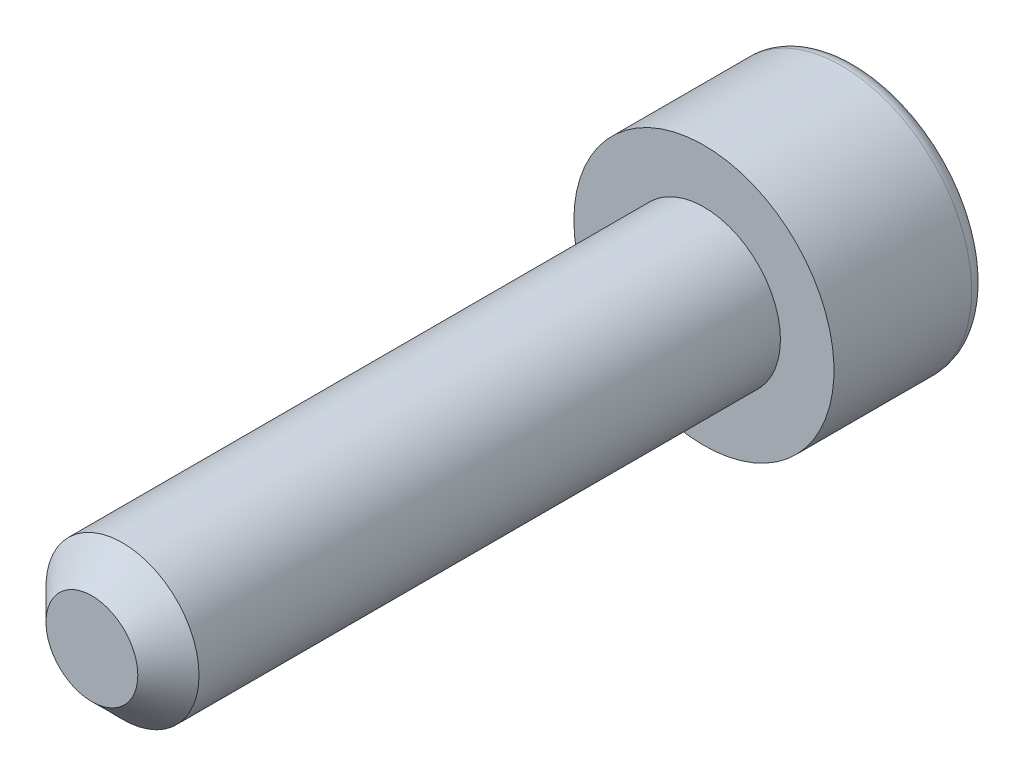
ISO-10303-21;
HEADER;
FILE_DESCRIPTION(('STEP AP214'),'2;1');
FILE_NAME('part.step','',(''),(''),'','','');
FILE_SCHEMA(('AUTOMOTIVE_DESIGN { 1 0 10303 214 1 1 1 1 }'));
ENDSEC;
DATA;
#1=APPLICATION_CONTEXT('core data for automotive mechanical design processes');
#2=APPLICATION_PROTOCOL_DEFINITION('international standard','automotive_design',2000,#1);
#3=PRODUCT_CONTEXT('',#1,'mechanical');
#4=PRODUCT('Part','Part','',(#3));
#5=PRODUCT_RELATED_PRODUCT_CATEGORY('part','',(#4));
#6=PRODUCT_DEFINITION_FORMATION('','',#4);
#7=PRODUCT_DEFINITION_CONTEXT('part definition',#1,'design');
#8=PRODUCT_DEFINITION('design','',#6,#7);
#9=PRODUCT_DEFINITION_SHAPE('','',#8);
#10=(LENGTH_UNIT() NAMED_UNIT(*) SI_UNIT(.MILLI.,.METRE.));
#11=(NAMED_UNIT(*) PLANE_ANGLE_UNIT() SI_UNIT($,.RADIAN.));
#12=(NAMED_UNIT(*) SI_UNIT($,.STERADIAN.) SOLID_ANGLE_UNIT());
#13=UNCERTAINTY_MEASURE_WITH_UNIT(LENGTH_MEASURE(1.E-05),#10,'distance_accuracy_value','');
#14=(GEOMETRIC_REPRESENTATION_CONTEXT(3) GLOBAL_UNCERTAINTY_ASSIGNED_CONTEXT((#13)) GLOBAL_UNIT_ASSIGNED_CONTEXT((#10,
#11,#12)) REPRESENTATION_CONTEXT('',''));
#15=CARTESIAN_POINT('',(0.,0.,0.));
#16=DIRECTION('',(0.,0.,1.));
#17=DIRECTION('',(1.,0.,0.));
#18=AXIS2_PLACEMENT_3D('',#15,#16,#17);
#19=CARTESIAN_POINT('',(0.,0.,-5.));
#20=DIRECTION('',(0.,0.,1.));
#21=DIRECTION('',(1.,0.,0.));
#22=AXIS2_PLACEMENT_3D('',#19,#20,#21);
#23=PLANE('',#22);
#24=CARTESIAN_POINT('',(0.,0.,-5.));
#25=DIRECTION('',(0.,0.,-1.));
#26=DIRECTION('',(-1.,0.,0.));
#27=AXIS2_PLACEMENT_3D('',#24,#25,#26);
#28=CIRCLE('',#27,3.75);
#29=CARTESIAN_POINT('',(-3.75,0.,-5.));
#30=VERTEX_POINT('',#29);
#31=EDGE_CURVE('E460',#30,#30,#28,.T.);
#32=ORIENTED_EDGE('',*,*,#31,.T.);
#33=EDGE_LOOP('',(#32));
#34=FACE_BOUND('',#33,.T.);
#35=DIRECTION('',(-0.86602540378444,0.499999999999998,0.));
#36=VECTOR('',#35,1.);
#37=CARTESIAN_POINT('',(0.,2.3094010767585,-5.));
#38=LINE('',#37,#36);
#39=CARTESIAN_POINT('',(2.,1.15470053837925,-5.));
#40=VERTEX_POINT('',#39);
#41=CARTESIAN_POINT('',(0.,2.3094010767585,-5.));
#42=VERTEX_POINT('',#41);
#43=EDGE_CURVE('E364',#40,#42,#38,.T.);
#44=ORIENTED_EDGE('',*,*,#43,.T.);
#45=DIRECTION('',(-0.866025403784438,-0.500000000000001,0.));
#46=VECTOR('',#45,1.);
#47=CARTESIAN_POINT('',(0.,2.3094010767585,-5.));
#48=LINE('',#47,#46);
#49=CARTESIAN_POINT('',(-2.,1.15470053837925,-5.));
#50=VERTEX_POINT('',#49);
#51=EDGE_CURVE('E404',#42,#50,#48,.T.);
#52=ORIENTED_EDGE('',*,*,#51,.T.);
#53=DIRECTION('',(0.,-1.,0.));
#54=VECTOR('',#53,1.);
#55=CARTESIAN_POINT('',(-2.,-1.15470053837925,-5.));
#56=LINE('',#55,#54);
#57=CARTESIAN_POINT('',(-2.,-1.15470053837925,-5.));
#58=VERTEX_POINT('',#57);
#59=EDGE_CURVE('E412',#50,#58,#56,.T.);
#60=ORIENTED_EDGE('',*,*,#59,.T.);
#61=DIRECTION('',(0.866025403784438,-0.500000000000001,0.));
#62=VECTOR('',#61,1.);
#63=CARTESIAN_POINT('',(0.,-2.3094010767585,-5.));
#64=LINE('',#63,#62);
#65=CARTESIAN_POINT('',(0.,-2.3094010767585,-5.));
#66=VERTEX_POINT('',#65);
#67=EDGE_CURVE('E430',#58,#66,#64,.T.);
#68=ORIENTED_EDGE('',*,*,#67,.T.);
#69=DIRECTION('',(0.86602540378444,0.499999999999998,0.));
#70=VECTOR('',#69,1.);
#71=CARTESIAN_POINT('',(0.,-2.3094010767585,-5.));
#72=LINE('',#71,#70);
#73=CARTESIAN_POINT('',(2.,-1.15470053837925,-5.));
#74=VERTEX_POINT('',#73);
#75=EDGE_CURVE('E433',#66,#74,#72,.T.);
#76=ORIENTED_EDGE('',*,*,#75,.T.);
#77=DIRECTION('',(0.,1.,0.));
#78=VECTOR('',#77,1.);
#79=CARTESIAN_POINT('',(2.,-1.15470053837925,-5.));
#80=LINE('',#79,#78);
#81=EDGE_CURVE('E423',#74,#40,#80,.T.);
#82=ORIENTED_EDGE('',*,*,#81,.T.);
#83=EDGE_LOOP('',(#44,#52,#60,#68,#76,#82));
#84=FACE_BOUND('',#83,.T.);
#85=ADVANCED_FACE('F350',(#34,#84),#23,.F.);
#86=CARTESIAN_POINT('',(0.,0.,-4.5));
#87=DIRECTION('',(0.,0.,-1.));
#88=DIRECTION('',(-1.,0.,0.));
#89=AXIS2_PLACEMENT_3D('',#86,#87,#88);
#90=TOROIDAL_SURFACE('',#89,3.75,0.5);
#91=ORIENTED_EDGE('',*,*,#31,.F.);
#92=EDGE_LOOP('',(#91));
#93=FACE_BOUND('',#92,.T.);
#94=CARTESIAN_POINT('',(0.,0.,-4.5));
#95=DIRECTION('',(0.,0.,-1.));
#96=DIRECTION('',(-1.,0.,0.));
#97=AXIS2_PLACEMENT_3D('',#94,#95,#96);
#98=CIRCLE('',#97,4.25);
#99=CARTESIAN_POINT('',(-4.25,0.,-4.5));
#100=VERTEX_POINT('',#99);
#101=EDGE_CURVE('E457',#100,#100,#98,.T.);
#102=ORIENTED_EDGE('',*,*,#101,.T.);
#103=EDGE_LOOP('',(#102));
#104=FACE_BOUND('',#103,.T.);
#105=ADVANCED_FACE('F479',(#93,#104),#90,.T.);
#106=CARTESIAN_POINT('',(0.,0.,0.));
#107=DIRECTION('',(0.,0.,-1.));
#108=DIRECTION('',(-1.,0.,0.));
#109=AXIS2_PLACEMENT_3D('',#106,#107,#108);
#110=CYLINDRICAL_SURFACE('',#109,4.25);
#111=ORIENTED_EDGE('',*,*,#101,.F.);
#112=EDGE_LOOP('',(#111));
#113=FACE_BOUND('',#112,.T.);
#114=CARTESIAN_POINT('',(0.,0.,0.));
#115=DIRECTION('',(0.,0.,-1.));
#116=DIRECTION('',(-1.,0.,0.));
#117=AXIS2_PLACEMENT_3D('',#114,#115,#116);
#118=CIRCLE('',#117,4.25);
#119=CARTESIAN_POINT('',(-4.25,0.,0.));
#120=VERTEX_POINT('',#119);
#121=EDGE_CURVE('E418',#120,#120,#118,.T.);
#122=ORIENTED_EDGE('',*,*,#121,.T.);
#123=EDGE_LOOP('',(#122));
#124=FACE_BOUND('',#123,.T.);
#125=ADVANCED_FACE('F484',(#113,#124),#110,.T.);
#126=CARTESIAN_POINT('',(0.,0.,0.));
#127=DIRECTION('',(0.,0.,-1.));
#128=DIRECTION('',(-1.,0.,0.));
#129=AXIS2_PLACEMENT_3D('',#126,#127,#128);
#130=PLANE('',#129);
#131=CARTESIAN_POINT('',(0.,0.,0.));
#132=DIRECTION('',(0.,0.,1.));
#133=DIRECTION('',(1.,0.,0.));
#134=AXIS2_PLACEMENT_3D('',#131,#132,#133);
#135=CIRCLE('',#134,2.5);
#136=CARTESIAN_POINT('',(2.5,0.,0.));
#137=VERTEX_POINT('',#136);
#138=EDGE_CURVE('E424',#137,#137,#135,.T.);
#139=ORIENTED_EDGE('',*,*,#138,.F.);
#140=EDGE_LOOP('',(#139));
#141=FACE_BOUND('',#140,.T.);
#142=ORIENTED_EDGE('',*,*,#121,.F.);
#143=EDGE_LOOP('',(#142));
#144=FACE_BOUND('',#143,.T.);
#145=ADVANCED_FACE('F492',(#141,#144),#130,.F.);
#146=CARTESIAN_POINT('',(0.,2.3094010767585,-2.5));
#147=DIRECTION('',(-0.499999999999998,-0.86602540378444,0.));
#148=DIRECTION('',(0.86602540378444,-0.499999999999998,0.));
#149=AXIS2_PLACEMENT_3D('',#146,#147,#148);
#150=PLANE('',#149);
#151=ORIENTED_EDGE('',*,*,#43,.F.);
#152=DIRECTION('',(0.,0.,-1.));
#153=VECTOR('',#152,1.);
#154=CARTESIAN_POINT('',(2.,1.15470053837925,-2.5));
#155=LINE('',#154,#153);
#156=CARTESIAN_POINT('',(2.,1.15470053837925,-2.5));
#157=VERTEX_POINT('',#156);
#158=EDGE_CURVE('E446',#157,#40,#155,.T.);
#159=ORIENTED_EDGE('',*,*,#158,.F.);
#160=DIRECTION('',(-0.86602540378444,0.499999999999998,0.));
#161=VECTOR('',#160,1.);
#162=CARTESIAN_POINT('',(0.,2.3094010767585,-2.5));
#163=LINE('',#162,#161);
#164=CARTESIAN_POINT('',(0.,2.3094010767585,-2.5));
#165=VERTEX_POINT('',#164);
#166=EDGE_CURVE('E417',#157,#165,#163,.T.);
#167=ORIENTED_EDGE('',*,*,#166,.T.);
#168=DIRECTION('',(0.,0.,-1.));
#169=VECTOR('',#168,1.);
#170=CARTESIAN_POINT('',(0.,2.3094010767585,-2.5));
#171=LINE('',#170,#169);
#172=EDGE_CURVE('E406',#165,#42,#171,.T.);
#173=ORIENTED_EDGE('',*,*,#172,.T.);
#174=EDGE_LOOP('',(#151,#159,#167,#173));
#175=FACE_BOUND('',#174,.T.);
#176=ADVANCED_FACE('F415',(#175),#150,.T.);
#177=CARTESIAN_POINT('',(0.,2.3094010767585,-2.5));
#178=DIRECTION('',(0.500000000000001,-0.866025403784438,0.));
#179=DIRECTION('',(0.866025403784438,0.500000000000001,0.));
#180=AXIS2_PLACEMENT_3D('',#177,#178,#179);
#181=PLANE('',#180);
#182=ORIENTED_EDGE('',*,*,#51,.F.);
#183=ORIENTED_EDGE('',*,*,#172,.F.);
#184=DIRECTION('',(-0.866025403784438,-0.500000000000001,0.));
#185=VECTOR('',#184,1.);
#186=CARTESIAN_POINT('',(0.,2.3094010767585,-2.5));
#187=LINE('',#186,#185);
#188=CARTESIAN_POINT('',(-2.,1.15470053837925,-2.5));
#189=VERTEX_POINT('',#188);
#190=EDGE_CURVE('E437',#165,#189,#187,.T.);
#191=ORIENTED_EDGE('',*,*,#190,.T.);
#192=DIRECTION('',(0.,0.,-1.));
#193=VECTOR('',#192,1.);
#194=CARTESIAN_POINT('',(-2.,1.15470053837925,-2.5));
#195=LINE('',#194,#193);
#196=EDGE_CURVE('E408',#189,#50,#195,.T.);
#197=ORIENTED_EDGE('',*,*,#196,.T.);
#198=EDGE_LOOP('',(#182,#183,#191,#197));
#199=FACE_BOUND('',#198,.T.);
#200=ADVANCED_FACE('F405',(#199),#181,.T.);
#201=CARTESIAN_POINT('',(-2.,-1.15470053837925,-2.5));
#202=DIRECTION('',(1.,0.,0.));
#203=DIRECTION('',(0.,0.,-1.));
#204=AXIS2_PLACEMENT_3D('',#201,#202,#203);
#205=PLANE('',#204);
#206=ORIENTED_EDGE('',*,*,#59,.F.);
#207=ORIENTED_EDGE('',*,*,#196,.F.);
#208=DIRECTION('',(0.,-1.,0.));
#209=VECTOR('',#208,1.);
#210=CARTESIAN_POINT('',(-2.,-1.15470053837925,-2.5));
#211=LINE('',#210,#209);
#212=CARTESIAN_POINT('',(-2.,-1.15470053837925,-2.5));
#213=VERTEX_POINT('',#212);
#214=EDGE_CURVE('E439',#189,#213,#211,.T.);
#215=ORIENTED_EDGE('',*,*,#214,.T.);
#216=DIRECTION('',(0.,0.,-1.));
#217=VECTOR('',#216,1.);
#218=CARTESIAN_POINT('',(-2.,-1.15470053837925,-2.5));
#219=LINE('',#218,#217);
#220=EDGE_CURVE('E452',#213,#58,#219,.T.);
#221=ORIENTED_EDGE('',*,*,#220,.T.);
#222=EDGE_LOOP('',(#206,#207,#215,#221));
#223=FACE_BOUND('',#222,.T.);
#224=ADVANCED_FACE('F507',(#223),#205,.T.);
#225=CARTESIAN_POINT('',(0.,-2.3094010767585,-2.5));
#226=DIRECTION('',(0.500000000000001,0.866025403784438,0.));
#227=DIRECTION('',(-0.866025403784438,0.500000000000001,0.));
#228=AXIS2_PLACEMENT_3D('',#225,#226,#227);
#229=PLANE('',#228);
#230=ORIENTED_EDGE('',*,*,#67,.F.);
#231=ORIENTED_EDGE('',*,*,#220,.F.);
#232=DIRECTION('',(0.866025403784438,-0.500000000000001,0.));
#233=VECTOR('',#232,1.);
#234=CARTESIAN_POINT('',(0.,-2.3094010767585,-2.5));
#235=LINE('',#234,#233);
#236=CARTESIAN_POINT('',(0.,-2.3094010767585,-2.5));
#237=VERTEX_POINT('',#236);
#238=EDGE_CURVE('E441',#213,#237,#235,.T.);
#239=ORIENTED_EDGE('',*,*,#238,.T.);
#240=DIRECTION('',(0.,0.,-1.));
#241=VECTOR('',#240,1.);
#242=CARTESIAN_POINT('',(0.,-2.3094010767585,-2.5));
#243=LINE('',#242,#241);
#244=EDGE_CURVE('E450',#237,#66,#243,.T.);
#245=ORIENTED_EDGE('',*,*,#244,.T.);
#246=EDGE_LOOP('',(#230,#231,#239,#245));
#247=FACE_BOUND('',#246,.T.);
#248=ADVANCED_FACE('F510',(#247),#229,.T.);
#249=CARTESIAN_POINT('',(0.,-2.3094010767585,-2.5));
#250=DIRECTION('',(-0.499999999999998,0.86602540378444,0.));
#251=DIRECTION('',(-0.86602540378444,-0.499999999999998,0.));
#252=AXIS2_PLACEMENT_3D('',#249,#250,#251);
#253=PLANE('',#252);
#254=ORIENTED_EDGE('',*,*,#75,.F.);
#255=ORIENTED_EDGE('',*,*,#244,.F.);
#256=DIRECTION('',(0.86602540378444,0.499999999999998,0.));
#257=VECTOR('',#256,1.);
#258=CARTESIAN_POINT('',(0.,-2.3094010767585,-2.5));
#259=LINE('',#258,#257);
#260=CARTESIAN_POINT('',(2.,-1.15470053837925,-2.5));
#261=VERTEX_POINT('',#260);
#262=EDGE_CURVE('E443',#237,#261,#259,.T.);
#263=ORIENTED_EDGE('',*,*,#262,.T.);
#264=DIRECTION('',(0.,0.,-1.));
#265=VECTOR('',#264,1.);
#266=CARTESIAN_POINT('',(2.,-1.15470053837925,-2.5));
#267=LINE('',#266,#265);
#268=EDGE_CURVE('E448',#261,#74,#267,.T.);
#269=ORIENTED_EDGE('',*,*,#268,.T.);
#270=EDGE_LOOP('',(#254,#255,#263,#269));
#271=FACE_BOUND('',#270,.T.);
#272=ADVANCED_FACE('F514',(#271),#253,.T.);
#273=CARTESIAN_POINT('',(2.,-1.15470053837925,-2.5));
#274=DIRECTION('',(-1.,0.,0.));
#275=DIRECTION('',(0.,0.,1.));
#276=AXIS2_PLACEMENT_3D('',#273,#274,#275);
#277=PLANE('',#276);
#278=ORIENTED_EDGE('',*,*,#81,.F.);
#279=ORIENTED_EDGE('',*,*,#268,.F.);
#280=DIRECTION('',(0.,1.,0.));
#281=VECTOR('',#280,1.);
#282=CARTESIAN_POINT('',(2.,-1.15470053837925,-2.5));
#283=LINE('',#282,#281);
#284=EDGE_CURVE('E371',#261,#157,#283,.T.);
#285=ORIENTED_EDGE('',*,*,#284,.T.);
#286=ORIENTED_EDGE('',*,*,#158,.T.);
#287=EDGE_LOOP('',(#278,#279,#285,#286));
#288=FACE_BOUND('',#287,.T.);
#289=ADVANCED_FACE('F518',(#288),#277,.T.);
#290=CARTESIAN_POINT('',(2.,1.15470053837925,-2.5));
#291=DIRECTION('',(0.,0.,1.));
#292=DIRECTION('',(1.,0.,0.));
#293=AXIS2_PLACEMENT_3D('',#290,#291,#292);
#294=PLANE('',#293);
#295=ORIENTED_EDGE('',*,*,#166,.F.);
#296=ORIENTED_EDGE('',*,*,#284,.F.);
#297=ORIENTED_EDGE('',*,*,#262,.F.);
#298=ORIENTED_EDGE('',*,*,#238,.F.);
#299=ORIENTED_EDGE('',*,*,#214,.F.);
#300=ORIENTED_EDGE('',*,*,#190,.F.);
#301=EDGE_LOOP('',(#295,#296,#297,#298,#299,#300));
#302=FACE_BOUND('',#301,.T.);
#303=ADVANCED_FACE('F522',(#302),#294,.F.);
#304=CARTESIAN_POINT('',(0.,0.,20.));
#305=DIRECTION('',(0.,0.,1.));
#306=DIRECTION('',(1.,0.,0.));
#307=AXIS2_PLACEMENT_3D('',#304,#305,#306);
#308=PLANE('',#307);
#309=CARTESIAN_POINT('',(0.,0.,20.));
#310=DIRECTION('',(0.,0.,1.));
#311=DIRECTION('',(1.,0.,0.));
#312=AXIS2_PLACEMENT_3D('',#309,#310,#311);
#313=CIRCLE('',#312,1.49999999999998);
#314=CARTESIAN_POINT('',(1.49999999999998,0.,20.));
#315=VERTEX_POINT('',#314);
#316=EDGE_CURVE('E357',#315,#315,#313,.T.);
#317=ORIENTED_EDGE('',*,*,#316,.T.);
#318=EDGE_LOOP('',(#317));
#319=FACE_BOUND('',#318,.T.);
#320=ADVANCED_FACE('F465',(#319),#308,.T.);
#321=CARTESIAN_POINT('',(0.,0.,0.));
#322=DIRECTION('',(0.,0.,1.));
#323=DIRECTION('',(1.,0.,0.));
#324=AXIS2_PLACEMENT_3D('',#321,#322,#323);
#325=CYLINDRICAL_SURFACE('',#324,2.5);
#326=CARTESIAN_POINT('',(0.,0.,19.));
#327=DIRECTION('',(0.,0.,1.));
#328=DIRECTION('',(1.,0.,0.));
#329=AXIS2_PLACEMENT_3D('',#326,#327,#328);
#330=CIRCLE('',#329,2.5);
#331=CARTESIAN_POINT('',(2.5,0.,19.));
#332=VERTEX_POINT('',#331);
#333=EDGE_CURVE('E11',#332,#332,#330,.F.);
#334=ORIENTED_EDGE('',*,*,#333,.T.);
#335=EDGE_LOOP('',(#334));
#336=FACE_BOUND('',#335,.T.);
#337=ORIENTED_EDGE('',*,*,#138,.T.);
#338=EDGE_LOOP('',(#337));
#339=FACE_BOUND('',#338,.T.);
#340=ADVANCED_FACE('F469',(#336,#339),#325,.T.);
#341=CARTESIAN_POINT('',(0.,0.,20.));
#342=DIRECTION('',(0.,0.,-1.));
#343=DIRECTION('',(-1.,0.,0.));
#344=AXIS2_PLACEMENT_3D('',#341,#342,#343);
#345=CONICAL_SURFACE('',#344,1.49999999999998,0.785398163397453);
#346=ORIENTED_EDGE('',*,*,#333,.F.);
#347=EDGE_LOOP('',(#346));
#348=FACE_BOUND('',#347,.T.);
#349=ORIENTED_EDGE('',*,*,#316,.F.);
#350=EDGE_LOOP('',(#349));
#351=FACE_BOUND('',#350,.T.);
#352=ADVANCED_FACE('F467',(#348,#351),#345,.T.);
#353=CLOSED_SHELL('',(#85,#105,#125,#145,#176,#200,#224,#248,#272,#289,#303,#320,#340,#352));
#354=MANIFOLD_SOLID_BREP('B2',#353);
#355=ADVANCED_BREP_SHAPE_REPRESENTATION('',(#18,#354),#14);
#356=SHAPE_DEFINITION_REPRESENTATION(#9,#355);
ENDSEC;
END-ISO-10303-21;
